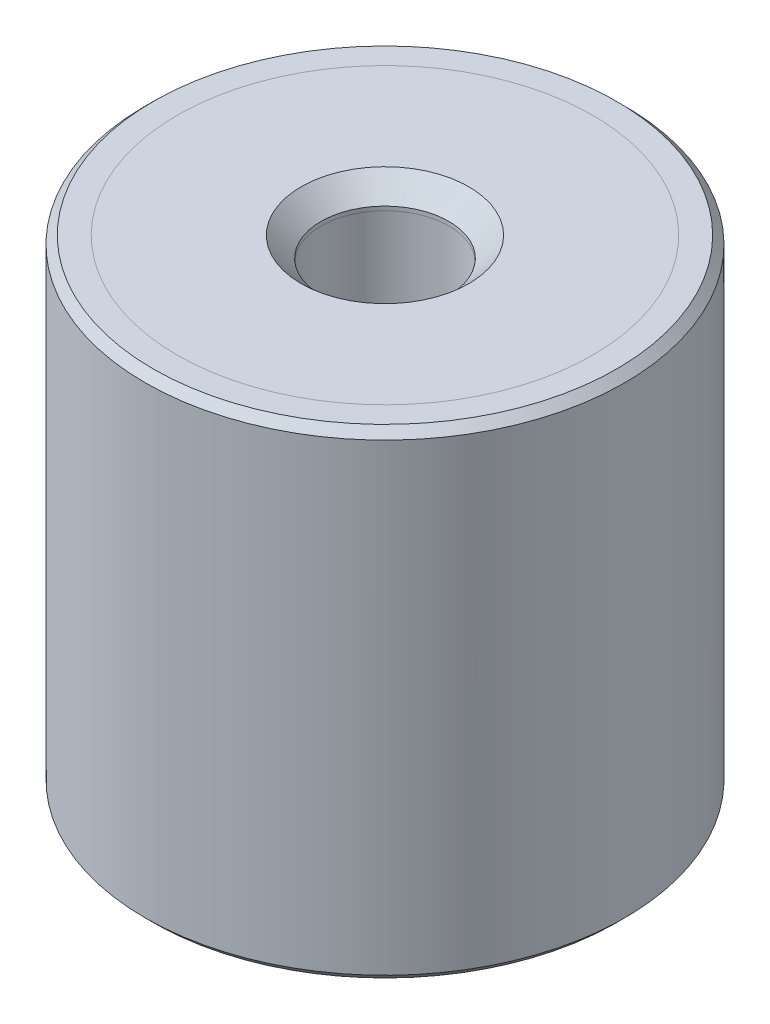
ISO-10303-21;
HEADER;
FILE_DESCRIPTION(('STEP AP214'),'2;1');
FILE_NAME('part.step','',(''),(''),'','','');
FILE_SCHEMA(('AUTOMOTIVE_DESIGN { 1 0 10303 214 1 1 1 1 }'));
ENDSEC;
DATA;
#1=APPLICATION_CONTEXT('core data for automotive mechanical design processes');
#2=APPLICATION_PROTOCOL_DEFINITION('international standard','automotive_design',2000,#1);
#3=PRODUCT_CONTEXT('',#1,'mechanical');
#4=PRODUCT('Part','Part','',(#3));
#5=PRODUCT_RELATED_PRODUCT_CATEGORY('part','',(#4));
#6=PRODUCT_DEFINITION_FORMATION('','',#4);
#7=PRODUCT_DEFINITION_CONTEXT('part definition',#1,'design');
#8=PRODUCT_DEFINITION('design','',#6,#7);
#9=PRODUCT_DEFINITION_SHAPE('','',#8);
#10=(LENGTH_UNIT() NAMED_UNIT(*) SI_UNIT(.MILLI.,.METRE.));
#11=(NAMED_UNIT(*) PLANE_ANGLE_UNIT() SI_UNIT($,.RADIAN.));
#12=(NAMED_UNIT(*) SI_UNIT($,.STERADIAN.) SOLID_ANGLE_UNIT());
#13=UNCERTAINTY_MEASURE_WITH_UNIT(LENGTH_MEASURE(1.E-05),#10,'distance_accuracy_value','');
#14=(GEOMETRIC_REPRESENTATION_CONTEXT(3) GLOBAL_UNCERTAINTY_ASSIGNED_CONTEXT((#13)) GLOBAL_UNIT_ASSIGNED_CONTEXT((#10,
#11,#12)) REPRESENTATION_CONTEXT('',''));
#15=CARTESIAN_POINT('',(0.,0.,0.));
#16=DIRECTION('',(0.,0.,1.));
#17=DIRECTION('',(1.,0.,0.));
#18=AXIS2_PLACEMENT_3D('',#15,#16,#17);
#19=CARTESIAN_POINT('',(0.,41.0340428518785,0.));
#20=DIRECTION('',(0.,1.,0.));
#21=DIRECTION('',(0.,0.,1.));
#22=AXIS2_PLACEMENT_3D('',#19,#20,#21);
#23=CYLINDRICAL_SURFACE('',#22,4.);
#24=CARTESIAN_POINT('',(0.,-27.25,0.));
#25=DIRECTION('',(0.,-1.,0.));
#26=DIRECTION('',(0.,0.,-1.));
#27=AXIS2_PLACEMENT_3D('',#24,#25,#26);
#28=CIRCLE('',#27,4.);
#29=CARTESIAN_POINT('',(0.,-27.25,-4.));
#30=VERTEX_POINT('',#29);
#31=EDGE_CURVE('P0_E10',#30,#30,#28,.T.);
#32=ORIENTED_EDGE('',*,*,#31,.T.);
#33=EDGE_LOOP('',(#32));
#34=FACE_BOUND('',#33,.T.);
#35=CARTESIAN_POINT('',(0.,-27.,0.));
#36=DIRECTION('',(0.,1.,0.));
#37=DIRECTION('',(0.,0.,1.));
#38=AXIS2_PLACEMENT_3D('',#35,#36,#37);
#39=CIRCLE('',#38,4.);
#40=CARTESIAN_POINT('',(0.,-27.,4.));
#41=VERTEX_POINT('',#40);
#42=EDGE_CURVE('P0_E25',#41,#41,#39,.T.);
#43=ORIENTED_EDGE('',*,*,#42,.T.);
#44=EDGE_LOOP('',(#43));
#45=FACE_BOUND('',#44,.T.);
#46=ADVANCED_FACE('P0_F14',(#34,#45),#23,.F.);
#47=CARTESIAN_POINT('',(0.,-27.,4.));
#48=DIRECTION('',(0.,1.,0.));
#49=DIRECTION('',(0.,0.,1.));
#50=AXIS2_PLACEMENT_3D('',#47,#48,#49);
#51=PLANE('',#50);
#52=CARTESIAN_POINT('',(0.,-27.,0.));
#53=DIRECTION('',(0.,1.,0.));
#54=DIRECTION('',(0.,0.,1.));
#55=AXIS2_PLACEMENT_3D('',#52,#53,#54);
#56=CIRCLE('',#55,13.);
#57=CARTESIAN_POINT('',(0.,-27.,13.));
#58=VERTEX_POINT('',#57);
#59=EDGE_CURVE('P0_E29',#58,#58,#56,.T.);
#60=ORIENTED_EDGE('',*,*,#59,.T.);
#61=EDGE_LOOP('',(#60));
#62=FACE_BOUND('',#61,.T.);
#63=ORIENTED_EDGE('',*,*,#42,.F.);
#64=EDGE_LOOP('',(#63));
#65=FACE_BOUND('',#64,.T.);
#66=ADVANCED_FACE('P0_F50',(#62,#65),#51,.T.);
#67=CARTESIAN_POINT('',(0.,41.0340428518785,0.));
#68=DIRECTION('',(0.,1.,0.));
#69=DIRECTION('',(0.,0.,1.));
#70=AXIS2_PLACEMENT_3D('',#67,#68,#69);
#71=CYLINDRICAL_SURFACE('',#70,13.);
#72=CARTESIAN_POINT('',(0.,-28.5,0.));
#73=DIRECTION('',(0.,1.,0.));
#74=DIRECTION('',(0.,0.,1.));
#75=AXIS2_PLACEMENT_3D('',#72,#73,#74);
#76=CIRCLE('',#75,13.);
#77=CARTESIAN_POINT('',(0.,-28.5,13.));
#78=VERTEX_POINT('',#77);
#79=EDGE_CURVE('P0_E34',#78,#78,#76,.T.);
#80=ORIENTED_EDGE('',*,*,#79,.T.);
#81=EDGE_LOOP('',(#80));
#82=FACE_BOUND('',#81,.T.);
#83=ORIENTED_EDGE('',*,*,#59,.F.);
#84=EDGE_LOOP('',(#83));
#85=FACE_BOUND('',#84,.T.);
#86=ADVANCED_FACE('P0_F38',(#82,#85),#71,.T.);
#87=CARTESIAN_POINT('',(0.,-28.5,13.));
#88=DIRECTION('',(0.,-1.,0.));
#89=DIRECTION('',(0.,0.,-1.));
#90=AXIS2_PLACEMENT_3D('',#87,#88,#89);
#91=PLANE('',#90);
#92=CARTESIAN_POINT('',(0.,-28.5,0.));
#93=DIRECTION('',(0.,-1.,0.));
#94=DIRECTION('',(0.,0.,-1.));
#95=AXIS2_PLACEMENT_3D('',#92,#93,#94);
#96=CIRCLE('',#95,5.25);
#97=CARTESIAN_POINT('',(0.,-28.5,-5.25));
#98=VERTEX_POINT('',#97);
#99=EDGE_CURVE('P0_E21',#98,#98,#96,.F.);
#100=ORIENTED_EDGE('',*,*,#99,.T.);
#101=EDGE_LOOP('',(#100));
#102=FACE_BOUND('',#101,.T.);
#103=ORIENTED_EDGE('',*,*,#79,.F.);
#104=EDGE_LOOP('',(#103));
#105=FACE_BOUND('',#104,.T.);
#106=ADVANCED_FACE('P0_F41',(#102,#105),#91,.T.);
#107=CARTESIAN_POINT('',(0.,-28.5,0.));
#108=DIRECTION('',(0.,-1.,0.));
#109=DIRECTION('',(0.,0.,-1.));
#110=AXIS2_PLACEMENT_3D('',#107,#108,#109);
#111=CONICAL_SURFACE('',#110,5.25,0.785398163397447);
#112=ORIENTED_EDGE('',*,*,#31,.F.);
#113=EDGE_LOOP('',(#112));
#114=FACE_BOUND('',#113,.T.);
#115=ORIENTED_EDGE('',*,*,#99,.F.);
#116=EDGE_LOOP('',(#115));
#117=FACE_BOUND('',#116,.T.);
#118=ADVANCED_FACE('P0_F16',(#114,#117),#111,.F.);
#119=CLOSED_SHELL('',(#46,#66,#86,#106,#118));
#120=MANIFOLD_SOLID_BREP('P0_B1',#119);
#121=CARTESIAN_POINT('',(0.,69.5340428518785,0.));
#122=DIRECTION('',(0.,1.,0.));
#123=DIRECTION('',(0.,0.,1.));
#124=AXIS2_PLACEMENT_3D('',#121,#122,#123);
#125=CYLINDRICAL_SURFACE('',#124,4.);
#126=CARTESIAN_POINT('',(0.,0.249999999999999,0.));
#127=DIRECTION('',(0.,1.,0.));
#128=DIRECTION('',(0.,0.,1.));
#129=AXIS2_PLACEMENT_3D('',#126,#127,#128);
#130=CIRCLE('',#129,4.);
#131=CARTESIAN_POINT('',(0.,0.249999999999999,4.));
#132=VERTEX_POINT('',#131);
#133=EDGE_CURVE('P1_E21',#132,#132,#130,.T.);
#134=ORIENTED_EDGE('',*,*,#133,.T.);
#135=EDGE_LOOP('',(#134));
#136=FACE_BOUND('',#135,.T.);
#137=CARTESIAN_POINT('',(0.,0.,0.));
#138=DIRECTION('',(0.,1.,0.));
#139=DIRECTION('',(0.,0.,1.));
#140=AXIS2_PLACEMENT_3D('',#137,#138,#139);
#141=CIRCLE('',#140,4.);
#142=CARTESIAN_POINT('',(0.,0.,4.));
#143=VERTEX_POINT('',#142);
#144=EDGE_CURVE('P1_E34',#143,#143,#141,.T.);
#145=ORIENTED_EDGE('',*,*,#144,.F.);
#146=EDGE_LOOP('',(#145));
#147=FACE_BOUND('',#146,.T.);
#148=ADVANCED_FACE('P1_F14',(#136,#147),#125,.F.);
#149=CARTESIAN_POINT('',(0.,1.5,4.));
#150=DIRECTION('',(0.,1.,0.));
#151=DIRECTION('',(0.,0.,1.));
#152=AXIS2_PLACEMENT_3D('',#149,#150,#151);
#153=PLANE('',#152);
#154=CARTESIAN_POINT('',(0.,1.5,0.));
#155=DIRECTION('',(0.,1.,0.));
#156=DIRECTION('',(0.,0.,1.));
#157=AXIS2_PLACEMENT_3D('',#154,#155,#156);
#158=CIRCLE('',#157,5.25);
#159=CARTESIAN_POINT('',(0.,1.5,5.25));
#160=VERTEX_POINT('',#159);
#161=EDGE_CURVE('P1_E10',#160,#160,#158,.F.);
#162=ORIENTED_EDGE('',*,*,#161,.T.);
#163=EDGE_LOOP('',(#162));
#164=FACE_BOUND('',#163,.T.);
#165=CARTESIAN_POINT('',(0.,1.5,0.));
#166=DIRECTION('',(0.,1.,0.));
#167=DIRECTION('',(0.,0.,1.));
#168=AXIS2_PLACEMENT_3D('',#165,#166,#167);
#169=CIRCLE('',#168,13.);
#170=CARTESIAN_POINT('',(0.,1.5,13.));
#171=VERTEX_POINT('',#170);
#172=EDGE_CURVE('P1_E25',#171,#171,#169,.T.);
#173=ORIENTED_EDGE('',*,*,#172,.T.);
#174=EDGE_LOOP('',(#173));
#175=FACE_BOUND('',#174,.T.);
#176=ADVANCED_FACE('P1_F42',(#164,#175),#153,.T.);
#177=CARTESIAN_POINT('',(0.,69.5340428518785,0.));
#178=DIRECTION('',(0.,1.,0.));
#179=DIRECTION('',(0.,0.,1.));
#180=AXIS2_PLACEMENT_3D('',#177,#178,#179);
#181=CYLINDRICAL_SURFACE('',#180,13.);
#182=CARTESIAN_POINT('',(0.,0.,0.));
#183=DIRECTION('',(0.,1.,0.));
#184=DIRECTION('',(0.,0.,1.));
#185=AXIS2_PLACEMENT_3D('',#182,#183,#184);
#186=CIRCLE('',#185,13.);
#187=CARTESIAN_POINT('',(0.,0.,13.));
#188=VERTEX_POINT('',#187);
#189=EDGE_CURVE('P1_E29',#188,#188,#186,.T.);
#190=ORIENTED_EDGE('',*,*,#189,.T.);
#191=EDGE_LOOP('',(#190));
#192=FACE_BOUND('',#191,.T.);
#193=ORIENTED_EDGE('',*,*,#172,.F.);
#194=EDGE_LOOP('',(#193));
#195=FACE_BOUND('',#194,.T.);
#196=ADVANCED_FACE('P1_F47',(#192,#195),#181,.T.);
#197=CARTESIAN_POINT('',(0.,0.,13.));
#198=DIRECTION('',(0.,-1.,0.));
#199=DIRECTION('',(0.,0.,-1.));
#200=AXIS2_PLACEMENT_3D('',#197,#198,#199);
#201=PLANE('',#200);
#202=ORIENTED_EDGE('',*,*,#144,.T.);
#203=EDGE_LOOP('',(#202));
#204=FACE_BOUND('',#203,.T.);
#205=ORIENTED_EDGE('',*,*,#189,.F.);
#206=EDGE_LOOP('',(#205));
#207=FACE_BOUND('',#206,.T.);
#208=ADVANCED_FACE('P1_F38',(#204,#207),#201,.T.);
#209=CARTESIAN_POINT('',(0.,0.249999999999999,0.));
#210=DIRECTION('',(0.,1.,0.));
#211=DIRECTION('',(0.,0.,1.));
#212=AXIS2_PLACEMENT_3D('',#209,#210,#211);
#213=CONICAL_SURFACE('',#212,4.,0.785398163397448);
#214=ORIENTED_EDGE('',*,*,#161,.F.);
#215=EDGE_LOOP('',(#214));
#216=FACE_BOUND('',#215,.T.);
#217=ORIENTED_EDGE('',*,*,#133,.F.);
#218=EDGE_LOOP('',(#217));
#219=FACE_BOUND('',#218,.T.);
#220=ADVANCED_FACE('P1_F16',(#216,#219),#213,.F.);
#221=CLOSED_SHELL('',(#148,#176,#196,#208,#220));
#222=MANIFOLD_SOLID_BREP('P1_B1',#221);
#223=CARTESIAN_POINT('',(0.,0.,0.));
#224=DIRECTION('',(0.,1.,0.));
#225=DIRECTION('',(0.,0.,1.));
#226=AXIS2_PLACEMENT_3D('',#223,#224,#225);
#227=PLANE('',#226);
#228=CARTESIAN_POINT('',(0.,0.,0.));
#229=DIRECTION('',(0.,1.,0.));
#230=DIRECTION('',(0.,0.,1.));
#231=AXIS2_PLACEMENT_3D('',#228,#229,#230);
#232=CIRCLE('',#231,4.);
#233=CARTESIAN_POINT('',(0.,0.,4.));
#234=VERTEX_POINT('',#233);
#235=EDGE_CURVE('P2_E46',#234,#234,#232,.T.);
#236=ORIENTED_EDGE('',*,*,#235,.F.);
#237=EDGE_LOOP('',(#236));
#238=FACE_BOUND('',#237,.T.);
#239=CARTESIAN_POINT('',(0.,0.,0.));
#240=DIRECTION('',(0.,1.,0.));
#241=DIRECTION('',(0.,0.,1.));
#242=AXIS2_PLACEMENT_3D('',#239,#240,#241);
#243=CIRCLE('',#242,13.);
#244=CARTESIAN_POINT('',(0.,0.,13.));
#245=VERTEX_POINT('',#244);
#246=EDGE_CURVE('P2_E33',#245,#245,#243,.T.);
#247=ORIENTED_EDGE('',*,*,#246,.T.);
#248=EDGE_LOOP('',(#247));
#249=FACE_BOUND('',#248,.T.);
#250=ADVANCED_FACE('P2_F13',(#238,#249),#227,.T.);
#251=CARTESIAN_POINT('',(0.,65.5134936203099,0.));
#252=DIRECTION('',(0.,1.,0.));
#253=DIRECTION('',(0.,0.,1.));
#254=AXIS2_PLACEMENT_3D('',#251,#252,#253);
#255=CYLINDRICAL_SURFACE('',#254,13.);
#256=CARTESIAN_POINT('',(0.,1.5,0.));
#257=DIRECTION('',(0.,1.,0.));
#258=DIRECTION('',(0.,0.,1.));
#259=AXIS2_PLACEMENT_3D('',#256,#257,#258);
#260=CIRCLE('',#259,13.);
#261=CARTESIAN_POINT('',(0.,1.5,13.));
#262=VERTEX_POINT('',#261);
#263=EDGE_CURVE('P2_E36',#262,#262,#260,.T.);
#264=ORIENTED_EDGE('',*,*,#263,.T.);
#265=EDGE_LOOP('',(#264));
#266=FACE_BOUND('',#265,.T.);
#267=ORIENTED_EDGE('',*,*,#246,.F.);
#268=EDGE_LOOP('',(#267));
#269=FACE_BOUND('',#268,.T.);
#270=ADVANCED_FACE('P2_F92',(#266,#269),#255,.F.);
#271=CARTESIAN_POINT('',(0.,1.5,13.));
#272=DIRECTION('',(0.,1.,0.));
#273=DIRECTION('',(0.,0.,1.));
#274=AXIS2_PLACEMENT_3D('',#271,#272,#273);
#275=PLANE('',#274);
#276=CARTESIAN_POINT('',(0.,1.5,0.));
#277=DIRECTION('',(0.,1.,0.));
#278=DIRECTION('',(0.,0.,1.));
#279=AXIS2_PLACEMENT_3D('',#276,#277,#278);
#280=CIRCLE('',#279,14.5);
#281=CARTESIAN_POINT('',(0.,1.5,14.5));
#282=VERTEX_POINT('',#281);
#283=EDGE_CURVE('P2_E9',#282,#282,#280,.T.);
#284=ORIENTED_EDGE('',*,*,#283,.T.);
#285=EDGE_LOOP('',(#284));
#286=FACE_BOUND('',#285,.T.);
#287=ORIENTED_EDGE('',*,*,#263,.F.);
#288=EDGE_LOOP('',(#287));
#289=FACE_BOUND('',#288,.T.);
#290=ADVANCED_FACE('P2_F88',(#286,#289),#275,.T.);
#291=CARTESIAN_POINT('',(0.,65.5134936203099,0.));
#292=DIRECTION('',(0.,1.,0.));
#293=DIRECTION('',(0.,0.,1.));
#294=AXIS2_PLACEMENT_3D('',#291,#292,#293);
#295=CYLINDRICAL_SURFACE('',#294,15.);
#296=CARTESIAN_POINT('',(0.,-28.,0.));
#297=DIRECTION('',(0.,-1.,0.));
#298=DIRECTION('',(0.,0.,-1.));
#299=AXIS2_PLACEMENT_3D('',#296,#297,#298);
#300=CIRCLE('',#299,15.);
#301=CARTESIAN_POINT('',(0.,-28.,-15.));
#302=VERTEX_POINT('',#301);
#303=EDGE_CURVE('P2_E24',#302,#302,#300,.F.);
#304=ORIENTED_EDGE('',*,*,#303,.T.);
#305=EDGE_LOOP('',(#304));
#306=FACE_BOUND('',#305,.T.);
#307=CARTESIAN_POINT('',(0.,1.,0.));
#308=DIRECTION('',(0.,1.,0.));
#309=DIRECTION('',(0.,0.,1.));
#310=AXIS2_PLACEMENT_3D('',#307,#308,#309);
#311=CIRCLE('',#310,15.);
#312=CARTESIAN_POINT('',(0.,1.,15.));
#313=VERTEX_POINT('',#312);
#314=EDGE_CURVE('P2_E28',#313,#313,#311,.F.);
#315=ORIENTED_EDGE('',*,*,#314,.T.);
#316=EDGE_LOOP('',(#315));
#317=FACE_BOUND('',#316,.T.);
#318=ADVANCED_FACE('P2_F82',(#306,#317),#295,.T.);
#319=CARTESIAN_POINT('',(0.,-28.5,15.));
#320=DIRECTION('',(0.,-1.,0.));
#321=DIRECTION('',(0.,0.,-1.));
#322=AXIS2_PLACEMENT_3D('',#319,#320,#321);
#323=PLANE('',#322);
#324=CARTESIAN_POINT('',(0.,-28.5,0.));
#325=DIRECTION('',(0.,-1.,0.));
#326=DIRECTION('',(0.,0.,-1.));
#327=AXIS2_PLACEMENT_3D('',#324,#325,#326);
#328=CIRCLE('',#327,14.5);
#329=CARTESIAN_POINT('',(0.,-28.5,-14.5));
#330=VERTEX_POINT('',#329);
#331=EDGE_CURVE('P2_E20',#330,#330,#328,.T.);
#332=ORIENTED_EDGE('',*,*,#331,.T.);
#333=EDGE_LOOP('',(#332));
#334=FACE_BOUND('',#333,.T.);
#335=CARTESIAN_POINT('',(0.,-28.5,0.));
#336=DIRECTION('',(0.,1.,0.));
#337=DIRECTION('',(0.,0.,1.));
#338=AXIS2_PLACEMENT_3D('',#335,#336,#337);
#339=CIRCLE('',#338,13.);
#340=CARTESIAN_POINT('',(0.,-28.5,13.));
#341=VERTEX_POINT('',#340);
#342=EDGE_CURVE('P2_E39',#341,#341,#339,.T.);
#343=ORIENTED_EDGE('',*,*,#342,.T.);
#344=EDGE_LOOP('',(#343));
#345=FACE_BOUND('',#344,.T.);
#346=ADVANCED_FACE('P2_F77',(#334,#345),#323,.T.);
#347=CARTESIAN_POINT('',(0.,65.5134936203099,0.));
#348=DIRECTION('',(0.,1.,0.));
#349=DIRECTION('',(0.,0.,1.));
#350=AXIS2_PLACEMENT_3D('',#347,#348,#349);
#351=CYLINDRICAL_SURFACE('',#350,13.);
#352=CARTESIAN_POINT('',(0.,-27.,0.));
#353=DIRECTION('',(0.,1.,0.));
#354=DIRECTION('',(0.,0.,1.));
#355=AXIS2_PLACEMENT_3D('',#352,#353,#354);
#356=CIRCLE('',#355,13.);
#357=CARTESIAN_POINT('',(0.,-27.,13.));
#358=VERTEX_POINT('',#357);
#359=EDGE_CURVE('P2_E42',#358,#358,#356,.T.);
#360=ORIENTED_EDGE('',*,*,#359,.T.);
#361=EDGE_LOOP('',(#360));
#362=FACE_BOUND('',#361,.T.);
#363=ORIENTED_EDGE('',*,*,#342,.F.);
#364=EDGE_LOOP('',(#363));
#365=FACE_BOUND('',#364,.T.);
#366=ADVANCED_FACE('P2_F71',(#362,#365),#351,.F.);
#367=CARTESIAN_POINT('',(0.,-27.,13.));
#368=DIRECTION('',(0.,-1.,0.));
#369=DIRECTION('',(0.,0.,-1.));
#370=AXIS2_PLACEMENT_3D('',#367,#368,#369);
#371=PLANE('',#370);
#372=CARTESIAN_POINT('',(0.,-27.,0.));
#373=DIRECTION('',(0.,-1.,0.));
#374=DIRECTION('',(0.,0.,-1.));
#375=AXIS2_PLACEMENT_3D('',#372,#373,#374);
#376=CIRCLE('',#375,4.);
#377=CARTESIAN_POINT('',(0.,-27.,-4.));
#378=VERTEX_POINT('',#377);
#379=EDGE_CURVE('P2_E52',#378,#378,#376,.T.);
#380=ORIENTED_EDGE('',*,*,#379,.F.);
#381=EDGE_LOOP('',(#380));
#382=FACE_BOUND('',#381,.T.);
#383=ORIENTED_EDGE('',*,*,#359,.F.);
#384=EDGE_LOOP('',(#383));
#385=FACE_BOUND('',#384,.T.);
#386=ADVANCED_FACE('P2_F67',(#382,#385),#371,.T.);
#387=CARTESIAN_POINT('',(0.,-28.,0.));
#388=DIRECTION('',(0.,1.,0.));
#389=DIRECTION('',(0.,0.,1.));
#390=AXIS2_PLACEMENT_3D('',#387,#388,#389);
#391=CONICAL_SURFACE('',#390,15.,0.785398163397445);
#392=ORIENTED_EDGE('',*,*,#331,.F.);
#393=EDGE_LOOP('',(#392));
#394=FACE_BOUND('',#393,.T.);
#395=ORIENTED_EDGE('',*,*,#303,.F.);
#396=EDGE_LOOP('',(#395));
#397=FACE_BOUND('',#396,.T.);
#398=ADVANCED_FACE('P2_F70',(#394,#397),#391,.T.);
#399=CARTESIAN_POINT('',(0.,1.5,0.));
#400=DIRECTION('',(0.,-1.,0.));
#401=DIRECTION('',(0.,0.,-1.));
#402=AXIS2_PLACEMENT_3D('',#399,#400,#401);
#403=CONICAL_SURFACE('',#402,14.5,0.785398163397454);
#404=ORIENTED_EDGE('',*,*,#314,.F.);
#405=EDGE_LOOP('',(#404));
#406=FACE_BOUND('',#405,.T.);
#407=ORIENTED_EDGE('',*,*,#283,.F.);
#408=EDGE_LOOP('',(#407));
#409=FACE_BOUND('',#408,.T.);
#410=ADVANCED_FACE('P2_F15',(#406,#409),#403,.T.);
#411=CARTESIAN_POINT('',(0.,-6.5,0.));
#412=DIRECTION('',(0.,1.,0.));
#413=DIRECTION('',(0.,0.,1.));
#414=AXIS2_PLACEMENT_3D('',#411,#412,#413);
#415=CYLINDRICAL_SURFACE('',#414,4.);
#416=CARTESIAN_POINT('',(0.,-6.5,0.));
#417=DIRECTION('',(0.,1.,0.));
#418=DIRECTION('',(0.,0.,1.));
#419=AXIS2_PLACEMENT_3D('',#416,#417,#418);
#420=CIRCLE('',#419,4.);
#421=CARTESIAN_POINT('',(0.,-6.5,4.));
#422=VERTEX_POINT('',#421);
#423=EDGE_CURVE('P2_E45',#422,#422,#420,.T.);
#424=CARTESIAN_POINT('',(0.,-6.5,4.));
#425=CARTESIAN_POINT('',(0.,-6.43229166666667,4.));
#426=CARTESIAN_POINT('',(0.,-6.36458333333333,4.));
#427=CARTESIAN_POINT('',(0.,-6.22916666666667,4.));
#428=CARTESIAN_POINT('',(0.,-6.16145833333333,4.));
#429=CARTESIAN_POINT('',(0.,-6.02604166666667,4.));
#430=CARTESIAN_POINT('',(0.,-5.95833333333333,4.));
#431=CARTESIAN_POINT('',(0.,-5.82291666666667,4.));
#432=CARTESIAN_POINT('',(0.,-5.75520833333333,4.));
#433=CARTESIAN_POINT('',(0.,-5.61979166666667,4.));
#434=CARTESIAN_POINT('',(0.,-5.55208333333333,4.));
#435=CARTESIAN_POINT('',(0.,-5.41666666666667,4.));
#436=CARTESIAN_POINT('',(0.,-5.34895833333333,4.));
#437=CARTESIAN_POINT('',(0.,-5.21354166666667,4.));
#438=CARTESIAN_POINT('',(0.,-5.14583333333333,4.));
#439=CARTESIAN_POINT('',(0.,-5.01041666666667,4.));
#440=CARTESIAN_POINT('',(0.,-4.94270833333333,4.));
#441=CARTESIAN_POINT('',(0.,-4.80729166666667,4.));
#442=CARTESIAN_POINT('',(0.,-4.73958333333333,4.));
#443=CARTESIAN_POINT('',(0.,-4.60416666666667,4.));
#444=CARTESIAN_POINT('',(0.,-4.53645833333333,4.));
#445=CARTESIAN_POINT('',(0.,-4.40104166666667,4.));
#446=CARTESIAN_POINT('',(0.,-4.33333333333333,4.));
#447=CARTESIAN_POINT('',(0.,-4.19791666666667,4.));
#448=CARTESIAN_POINT('',(0.,-4.13020833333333,4.));
#449=CARTESIAN_POINT('',(0.,-3.99479166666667,4.));
#450=CARTESIAN_POINT('',(0.,-3.92708333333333,4.));
#451=CARTESIAN_POINT('',(0.,-3.79166666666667,4.));
#452=CARTESIAN_POINT('',(0.,-3.72395833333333,4.));
#453=CARTESIAN_POINT('',(0.,-3.58854166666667,4.));
#454=CARTESIAN_POINT('',(0.,-3.52083333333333,4.));
#455=CARTESIAN_POINT('',(0.,-3.38541666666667,4.));
#456=CARTESIAN_POINT('',(0.,-3.31770833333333,4.));
#457=CARTESIAN_POINT('',(0.,-3.18229166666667,4.));
#458=CARTESIAN_POINT('',(0.,-3.11458333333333,4.));
#459=CARTESIAN_POINT('',(0.,-2.97916666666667,4.));
#460=CARTESIAN_POINT('',(0.,-2.91145833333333,4.));
#461=CARTESIAN_POINT('',(0.,-2.77604166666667,4.));
#462=CARTESIAN_POINT('',(0.,-2.70833333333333,4.));
#463=CARTESIAN_POINT('',(0.,-2.57291666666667,4.));
#464=CARTESIAN_POINT('',(0.,-2.50520833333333,4.));
#465=CARTESIAN_POINT('',(0.,-2.36979166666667,4.));
#466=CARTESIAN_POINT('',(0.,-2.30208333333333,4.));
#467=CARTESIAN_POINT('',(0.,-2.16666666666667,4.));
#468=CARTESIAN_POINT('',(0.,-2.09895833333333,4.));
#469=CARTESIAN_POINT('',(0.,-1.96354166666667,4.));
#470=CARTESIAN_POINT('',(0.,-1.89583333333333,4.));
#471=CARTESIAN_POINT('',(0.,-1.76041666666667,4.));
#472=CARTESIAN_POINT('',(0.,-1.69270833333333,4.));
#473=CARTESIAN_POINT('',(0.,-1.55729166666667,4.));
#474=CARTESIAN_POINT('',(0.,-1.48958333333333,4.));
#475=CARTESIAN_POINT('',(0.,-1.35416666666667,4.));
#476=CARTESIAN_POINT('',(0.,-1.28645833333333,4.));
#477=CARTESIAN_POINT('',(0.,-1.15104166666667,4.));
#478=CARTESIAN_POINT('',(0.,-1.08333333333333,4.));
#479=CARTESIAN_POINT('',(0.,-0.947916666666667,4.));
#480=CARTESIAN_POINT('',(0.,-0.880208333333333,4.));
#481=CARTESIAN_POINT('',(0.,-0.744791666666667,4.));
#482=CARTESIAN_POINT('',(0.,-0.677083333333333,4.));
#483=CARTESIAN_POINT('',(0.,-0.541666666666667,4.));
#484=CARTESIAN_POINT('',(0.,-0.473958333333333,4.));
#485=CARTESIAN_POINT('',(0.,-0.338541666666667,4.));
#486=CARTESIAN_POINT('',(0.,-0.270833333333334,4.));
#487=CARTESIAN_POINT('',(0.,-0.135416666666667,4.));
#488=CARTESIAN_POINT('',(0.,-0.0677083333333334,4.));
#489=CARTESIAN_POINT('',(0.,0.,4.));
#490=B_SPLINE_CURVE_WITH_KNOTS('',3,(#424,#425,#426,#427,#428,#429,#430,#431,#432,#433,#434,
#435,#436,#437,#438,#439,#440,#441,#442,#443,#444,#445,#446,#447,#448,#449,#450,#451,#452,#453,
#454,#455,#456,#457,#458,#459,#460,#461,#462,#463,#464,#465,#466,#467,#468,#469,#470,#471,#472,
#473,#474,#475,#476,#477,#478,#479,#480,#481,#482,#483,#484,#485,#486,#487,#488,#489),
.UNSPECIFIED.,.F.,.F.,(4,2,2,2,2,2,2,2,2,2,2,2,2,2,2,2,2,2,2,2,2,2,2,2,2,2,2,2,2,2,2,2,4),(0.,
0.203124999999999,0.40625,0.609375,0.8125,1.015625,1.21875,1.421875,1.625,1.828125,2.03125,
2.234375,2.4375,2.640625,2.84375,3.046875,3.25,3.453125,3.65625,3.859375,4.0625,4.265625,
4.46875,4.671875,4.875,5.078125,5.28125,5.484375,5.6875,5.890625,6.09375,6.296875,6.5),.UNSPECIFIED.);
#491=EDGE_CURVE('P2_BSEAM108',#422,#234,#490,.T.);
#492=ORIENTED_EDGE('',*,*,#423,.F.);
#493=ORIENTED_EDGE('',*,*,#235,.T.);
#494=ORIENTED_EDGE('',*,*,#491,.T.);
#495=ORIENTED_EDGE('',*,*,#491,.F.);
#496=EDGE_LOOP('',(#492,#494,#493,#495));
#497=FACE_BOUND('',#496,.T.);
#498=ADVANCED_FACE('P2_F108',(#497),#415,.F.);
#499=CARTESIAN_POINT('',(0.,-6.5,0.));
#500=DIRECTION('',(0.,1.,0.));
#501=DIRECTION('',(0.,0.,1.));
#502=AXIS2_PLACEMENT_3D('',#499,#500,#501);
#503=PLANE('',#502);
#504=ORIENTED_EDGE('',*,*,#423,.T.);
#505=EDGE_LOOP('',(#504));
#506=FACE_BOUND('',#505,.T.);
#507=ADVANCED_FACE('P2_F63',(#506),#503,.T.);
#508=CARTESIAN_POINT('',(0.,-20.5,0.));
#509=DIRECTION('',(0.,-1.,0.));
#510=DIRECTION('',(0.,0.,-1.));
#511=AXIS2_PLACEMENT_3D('',#508,#509,#510);
#512=CYLINDRICAL_SURFACE('',#511,4.);
#513=CARTESIAN_POINT('',(0.,-20.5,0.));
#514=DIRECTION('',(0.,-1.,0.));
#515=DIRECTION('',(0.,0.,-1.));
#516=AXIS2_PLACEMENT_3D('',#513,#514,#515);
#517=CIRCLE('',#516,4.);
#518=CARTESIAN_POINT('',(0.,-20.5,-4.));
#519=VERTEX_POINT('',#518);
#520=EDGE_CURVE('P2_E49',#519,#519,#517,.T.);
#521=CARTESIAN_POINT('',(0.,-20.5,-4.));
#522=CARTESIAN_POINT('',(0.,-20.5677083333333,-4.));
#523=CARTESIAN_POINT('',(0.,-20.6354166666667,-4.));
#524=CARTESIAN_POINT('',(0.,-20.7708333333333,-4.));
#525=CARTESIAN_POINT('',(0.,-20.8385416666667,-4.));
#526=CARTESIAN_POINT('',(0.,-20.9739583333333,-4.));
#527=CARTESIAN_POINT('',(0.,-21.0416666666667,-4.));
#528=CARTESIAN_POINT('',(0.,-21.1770833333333,-4.));
#529=CARTESIAN_POINT('',(0.,-21.2447916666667,-4.));
#530=CARTESIAN_POINT('',(0.,-21.3802083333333,-4.));
#531=CARTESIAN_POINT('',(0.,-21.4479166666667,-4.));
#532=CARTESIAN_POINT('',(0.,-21.5833333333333,-4.));
#533=CARTESIAN_POINT('',(0.,-21.6510416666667,-4.));
#534=CARTESIAN_POINT('',(0.,-21.7864583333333,-4.));
#535=CARTESIAN_POINT('',(0.,-21.8541666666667,-4.));
#536=CARTESIAN_POINT('',(0.,-21.9895833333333,-4.));
#537=CARTESIAN_POINT('',(0.,-22.0572916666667,-4.));
#538=CARTESIAN_POINT('',(0.,-22.1927083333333,-4.));
#539=CARTESIAN_POINT('',(0.,-22.2604166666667,-4.));
#540=CARTESIAN_POINT('',(0.,-22.3958333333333,-4.));
#541=CARTESIAN_POINT('',(0.,-22.4635416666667,-4.));
#542=CARTESIAN_POINT('',(0.,-22.5989583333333,-4.));
#543=CARTESIAN_POINT('',(0.,-22.6666666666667,-4.));
#544=CARTESIAN_POINT('',(0.,-22.8020833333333,-4.));
#545=CARTESIAN_POINT('',(0.,-22.8697916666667,-4.));
#546=CARTESIAN_POINT('',(0.,-23.0052083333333,-4.));
#547=CARTESIAN_POINT('',(0.,-23.0729166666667,-4.));
#548=CARTESIAN_POINT('',(0.,-23.2083333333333,-4.));
#549=CARTESIAN_POINT('',(0.,-23.2760416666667,-4.));
#550=CARTESIAN_POINT('',(0.,-23.4114583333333,-4.));
#551=CARTESIAN_POINT('',(0.,-23.4791666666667,-4.));
#552=CARTESIAN_POINT('',(0.,-23.6145833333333,-4.));
#553=CARTESIAN_POINT('',(0.,-23.6822916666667,-4.));
#554=CARTESIAN_POINT('',(0.,-23.8177083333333,-4.));
#555=CARTESIAN_POINT('',(0.,-23.8854166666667,-4.));
#556=CARTESIAN_POINT('',(0.,-24.0208333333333,-4.));
#557=CARTESIAN_POINT('',(0.,-24.0885416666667,-4.));
#558=CARTESIAN_POINT('',(0.,-24.2239583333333,-4.));
#559=CARTESIAN_POINT('',(0.,-24.2916666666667,-4.));
#560=CARTESIAN_POINT('',(0.,-24.4270833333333,-4.));
#561=CARTESIAN_POINT('',(0.,-24.4947916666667,-4.));
#562=CARTESIAN_POINT('',(0.,-24.6302083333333,-4.));
#563=CARTESIAN_POINT('',(0.,-24.6979166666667,-4.));
#564=CARTESIAN_POINT('',(0.,-24.8333333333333,-4.));
#565=CARTESIAN_POINT('',(0.,-24.9010416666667,-4.));
#566=CARTESIAN_POINT('',(0.,-25.0364583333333,-4.));
#567=CARTESIAN_POINT('',(0.,-25.1041666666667,-4.));
#568=CARTESIAN_POINT('',(0.,-25.2395833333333,-4.));
#569=CARTESIAN_POINT('',(0.,-25.3072916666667,-4.));
#570=CARTESIAN_POINT('',(0.,-25.4427083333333,-4.));
#571=CARTESIAN_POINT('',(0.,-25.5104166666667,-4.));
#572=CARTESIAN_POINT('',(0.,-25.6458333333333,-4.));
#573=CARTESIAN_POINT('',(0.,-25.7135416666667,-4.));
#574=CARTESIAN_POINT('',(0.,-25.8489583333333,-4.));
#575=CARTESIAN_POINT('',(0.,-25.9166666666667,-4.));
#576=CARTESIAN_POINT('',(0.,-26.0520833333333,-4.));
#577=CARTESIAN_POINT('',(0.,-26.1197916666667,-4.));
#578=CARTESIAN_POINT('',(0.,-26.2552083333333,-4.));
#579=CARTESIAN_POINT('',(0.,-26.3229166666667,-4.));
#580=CARTESIAN_POINT('',(0.,-26.4583333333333,-4.));
#581=CARTESIAN_POINT('',(0.,-26.5260416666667,-4.));
#582=CARTESIAN_POINT('',(0.,-26.6614583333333,-4.));
#583=CARTESIAN_POINT('',(0.,-26.7291666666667,-4.));
#584=CARTESIAN_POINT('',(0.,-26.8645833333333,-4.));
#585=CARTESIAN_POINT('',(0.,-26.9322916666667,-4.));
#586=CARTESIAN_POINT('',(0.,-27.,-4.));
#587=B_SPLINE_CURVE_WITH_KNOTS('',3,(#521,#522,#523,#524,#525,#526,#527,#528,#529,#530,#531,
#532,#533,#534,#535,#536,#537,#538,#539,#540,#541,#542,#543,#544,#545,#546,#547,#548,#549,#550,
#551,#552,#553,#554,#555,#556,#557,#558,#559,#560,#561,#562,#563,#564,#565,#566,#567,#568,#569,
#570,#571,#572,#573,#574,#575,#576,#577,#578,#579,#580,#581,#582,#583,#584,#585,#586),
.UNSPECIFIED.,.F.,.F.,(4,2,2,2,2,2,2,2,2,2,2,2,2,2,2,2,2,2,2,2,2,2,2,2,2,2,2,2,2,2,2,2,4),(0.,
0.203124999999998,0.406249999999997,0.609374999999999,0.812499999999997,1.015625,1.21875,
1.421875,1.625,1.828125,2.03125,2.234375,2.4375,2.640625,2.84375,3.046875,3.25,3.453125,3.65625,
3.859375,4.0625,4.26562499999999,4.46875,4.671875,4.875,5.078125,5.28125,5.484375,5.6875,
5.890625,6.09374999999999,6.296875,6.5),.UNSPECIFIED.);
#588=EDGE_CURVE('P2_BSEAM60',#519,#378,#587,.T.);
#589=ORIENTED_EDGE('',*,*,#520,.F.);
#590=ORIENTED_EDGE('',*,*,#379,.T.);
#591=ORIENTED_EDGE('',*,*,#588,.T.);
#592=ORIENTED_EDGE('',*,*,#588,.F.);
#593=EDGE_LOOP('',(#589,#591,#590,#592));
#594=FACE_BOUND('',#593,.T.);
#595=ADVANCED_FACE('P2_F60',(#594),#512,.F.);
#596=CARTESIAN_POINT('',(0.,-20.5,0.));
#597=DIRECTION('',(0.,-1.,0.));
#598=DIRECTION('',(0.,0.,-1.));
#599=AXIS2_PLACEMENT_3D('',#596,#597,#598);
#600=PLANE('',#599);
#601=ORIENTED_EDGE('',*,*,#520,.T.);
#602=EDGE_LOOP('',(#601));
#603=FACE_BOUND('',#602,.T.);
#604=ADVANCED_FACE('P2_F58',(#603),#600,.T.);
#605=CLOSED_SHELL('',(#250,#270,#290,#318,#346,#366,#386,#398,#410,#498,#507,#595,#604));
#606=MANIFOLD_SOLID_BREP('P2_B1',#605);
#607=ADVANCED_BREP_SHAPE_REPRESENTATION('',(#18,#120,#222,#606),#14);
#608=SHAPE_DEFINITION_REPRESENTATION(#9,#607);
ENDSEC;
END-ISO-10303-21;
